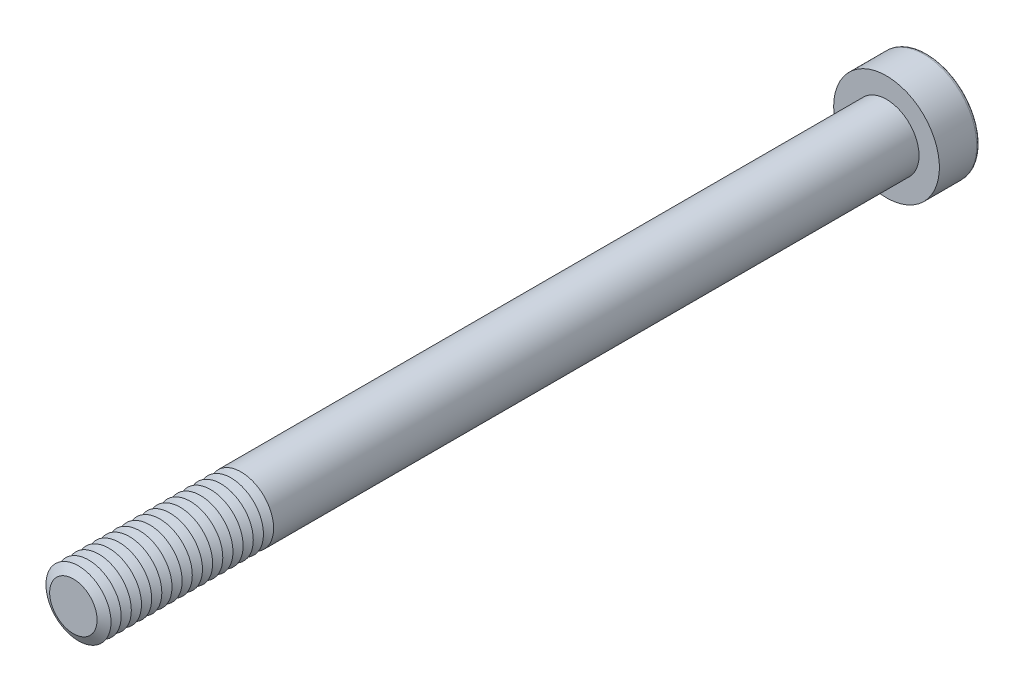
from build123d import *

# Parameters (mm, degrees)
SKETCH1_R           = 4
BOSS_EXTRUDE1_DEPTH = 100
SKETCH2_R           = 6.5
BOSS_EXTRUDE2_DEPTH = 5
CUT_EXTRUDE1_DEPTH  = 3.75
FILLET1_R           = 0.4
LPATTERN1_COUNT     = 17
LPATTERN1_PITCH     = 1.25


with BuildPart() as part:
    # Sketch1 → Boss-Extrude1 (new body)
    with BuildSketch(Plane.XY):
        Circle(SKETCH1_R)
    extrude(amount=BOSS_EXTRUDE1_DEPTH)

    # Sketch2 → Boss-Extrude2 (add)
    with BuildSketch(Plane(origin=(0, 0, 0), x_dir=(-1, 0, 0), z_dir=(0, 0, -1))):
        Circle(SKETCH2_R)
    extrude(amount=BOSS_EXTRUDE2_DEPTH)

    # Sketch3 → Cut-Extrude1 (cut)
    with BuildSketch(Plane(origin=(0, 0, -5), x_dir=(-1, 0, 0), z_dir=(0, 0, -1))):
        Polygon((-1.443375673, 2.5), (-2.886751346, 0), (-1.443375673, -2.5), (1.443375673, -2.5), (2.886751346, 0), (1.443375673, 2.5), align=None)
    extrude(amount=-CUT_EXTRUDE1_DEPTH, mode=Mode.SUBTRACT)

    # Fillet1
    fillet1_edges = [part.edges().sort_by_distance(p)[0] for p in [
        (6.5, 0, -5),
    ]]
    fillet(fillet1_edges, radius=FILLET1_R)

    # Cut-Extrude2 cone 1 section (on through the dimple's axis) → Cut-Extrude2 (revolve, cut)
    with BuildSketch(Plane(origin=(0, 0, -1.25), x_dir=(0, 1, 0), z_dir=(1, 0, 0))):
        Polygon((0, 0), (2.5, 0), (0, 1.443375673), align=None)
    revolve(axis=Axis((0, 0, -1.25), (0, 0, 1)), mode=Mode.SUBTRACT)

    # Cut-Extrude3 cone 1 section (on through the dimple's axis) → Cut-Extrude3 (revolve, cut)
    with BuildSketch(Plane(origin=(0, 0, -5), x_dir=(0, 1, 0), z_dir=(1, 0, 0))):
        Polygon((0, 0), (2.886751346, 0), (0, 0.773502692), align=None)
    revolve(axis=Axis((0, 0, -5), (0, 0, 1)), mode=Mode.SUBTRACT)

    # Sketch7 → Cut-Revolve1 (revolve, cut)
    with BuildSketch(Plane(origin=(0, 0, 0), x_dir=(0, 0, -1), z_dir=(1, 0, 0)), mode=Mode.PRIVATE) as cut_revolve1_sk:
        Polygon((-100, 2.917468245), (-99.375, 4), (-100.625, 4), align=None)
    cut_revolve1 = revolve(cut_revolve1_sk.sketch.rotate(Axis((0, 0, 100), (0, 0, -1)), 90), axis=Axis((0, 0, 100), (0, 0, -1)), mode=Mode.SUBTRACT)

    # LPattern1: Cut-Revolve1 ×17
    with Locations(*[(0, 0, -i * LPATTERN1_PITCH) for i in range(1, LPATTERN1_COUNT)]):
        add(cut_revolve1, mode=Mode.SUBTRACT)


solid = part.part
